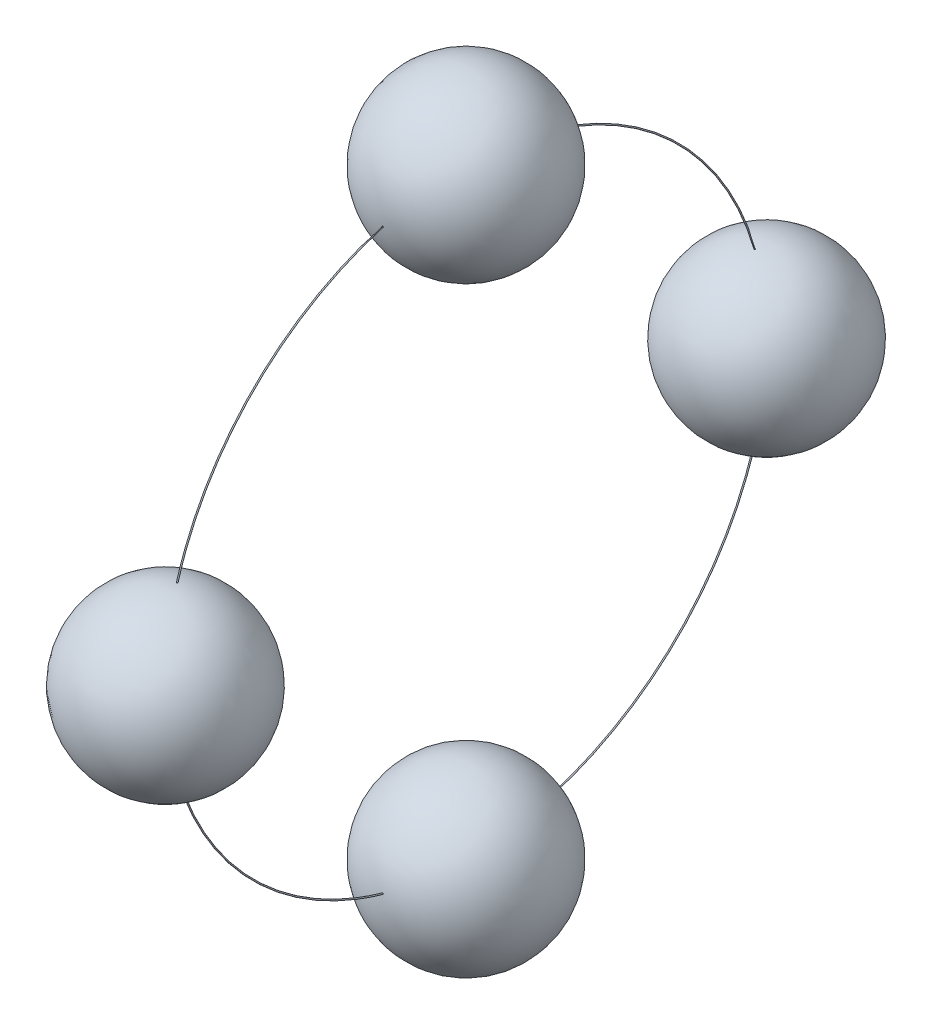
ISO-10303-21;
HEADER;
FILE_DESCRIPTION(('STEP AP214'),'2;1');
FILE_NAME('part.step','',(''),(''),'','','');
FILE_SCHEMA(('AUTOMOTIVE_DESIGN { 1 0 10303 214 1 1 1 1 }'));
ENDSEC;
DATA;
#1=APPLICATION_CONTEXT('core data for automotive mechanical design processes');
#2=APPLICATION_PROTOCOL_DEFINITION('international standard','automotive_design',2000,#1);
#3=PRODUCT_CONTEXT('',#1,'mechanical');
#4=PRODUCT('Part','Part','',(#3));
#5=PRODUCT_RELATED_PRODUCT_CATEGORY('part','',(#4));
#6=PRODUCT_DEFINITION_FORMATION('','',#4);
#7=PRODUCT_DEFINITION_CONTEXT('part definition',#1,'design');
#8=PRODUCT_DEFINITION('design','',#6,#7);
#9=PRODUCT_DEFINITION_SHAPE('','',#8);
#10=(LENGTH_UNIT() NAMED_UNIT(*) SI_UNIT(.MILLI.,.METRE.));
#11=(NAMED_UNIT(*) PLANE_ANGLE_UNIT() SI_UNIT($,.RADIAN.));
#12=(NAMED_UNIT(*) SI_UNIT($,.STERADIAN.) SOLID_ANGLE_UNIT());
#13=UNCERTAINTY_MEASURE_WITH_UNIT(LENGTH_MEASURE(1.E-05),#10,'distance_accuracy_value','');
#14=(GEOMETRIC_REPRESENTATION_CONTEXT(3) GLOBAL_UNCERTAINTY_ASSIGNED_CONTEXT((#13)) GLOBAL_UNIT_ASSIGNED_CONTEXT((#10,
#11,#12)) REPRESENTATION_CONTEXT('',''));
#15=CARTESIAN_POINT('',(0.,0.,0.));
#16=DIRECTION('',(0.,0.,1.));
#17=DIRECTION('',(1.,0.,0.));
#18=AXIS2_PLACEMENT_3D('',#15,#16,#17);
#19=CARTESIAN_POINT('',(4.5,0.,0.));
#20=DIRECTION('',(1.,0.,0.));
#21=DIRECTION('',(0.,-1.,0.));
#22=AXIS2_PLACEMENT_3D('',#19,#20,#21);
#23=TOROIDAL_SURFACE('',#22,10.,0.02);
#24=CARTESIAN_POINT('',(4.48828860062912,-2.77464620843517,-9.6242324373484));
#25=CARTESIAN_POINT('',(4.48737404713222,-2.77455286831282,-9.62357172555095));
#26=CARTESIAN_POINT('',(4.48651555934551,-2.77444856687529,-9.62283345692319));
#27=CARTESIAN_POINT('',(4.48493558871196,-2.77422113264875,-9.621223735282));
#28=CARTESIAN_POINT('',(4.48421428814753,-2.77409797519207,-9.62035210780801));
#29=CARTESIAN_POINT('',(4.48292990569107,-2.77383658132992,-9.61850227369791));
#30=CARTESIAN_POINT('',(4.48236668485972,-2.77369835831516,-9.61752416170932));
#31=CARTESIAN_POINT('',(4.48141298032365,-2.77341073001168,-9.61548897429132));
#32=CARTESIAN_POINT('',(4.48102245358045,-2.77326132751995,-9.61443191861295));
#33=CARTESIAN_POINT('',(4.48042217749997,-2.77295446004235,-9.61226094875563));
#34=CARTESIAN_POINT('',(4.48021366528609,-2.77279694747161,-9.61114669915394));
#35=CARTESIAN_POINT('',(4.47998744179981,-2.77247922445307,-9.60889931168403));
#36=CARTESIAN_POINT('',(4.47996974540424,-2.7723190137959,-9.60776617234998));
#37=CARTESIAN_POINT('',(4.48012605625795,-2.77199957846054,-9.60550706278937));
#38=CARTESIAN_POINT('',(4.48030104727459,-2.77184036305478,-9.60438115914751));
#39=CARTESIAN_POINT('',(4.48083963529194,-2.77152828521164,-9.60217446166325));
#40=CARTESIAN_POINT('',(4.48120323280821,-2.77137542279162,-9.60109366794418));
#41=CARTESIAN_POINT('',(4.48210873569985,-2.7710805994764,-9.59900932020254));
#42=CARTESIAN_POINT('',(4.48265044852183,-2.77093862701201,-9.59800568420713));
#43=CARTESIAN_POINT('',(4.48389747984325,-2.77066953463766,-9.59610354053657));
#44=CARTESIAN_POINT('',(4.48460279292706,-2.77054241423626,-9.59520502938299));
#45=CARTESIAN_POINT('',(4.48615200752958,-2.77030760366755,-9.59354544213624));
#46=CARTESIAN_POINT('',(4.4869949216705,-2.77019978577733,-9.59278346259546));
#47=CARTESIAN_POINT('',(4.48879907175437,-2.77000573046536,-9.59141208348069));
#48=CARTESIAN_POINT('',(4.4897603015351,-2.76991949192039,-9.59080267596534));
#49=CARTESIAN_POINT('',(4.49176384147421,-2.76977193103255,-9.58975996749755));
#50=CARTESIAN_POINT('',(4.49280527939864,-2.76971037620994,-9.58932502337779));
#51=CARTESIAN_POINT('',(4.49494749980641,-2.76961286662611,-9.58863603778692));
#52=CARTESIAN_POINT('',(4.49604827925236,-2.76957691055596,-9.58838198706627));
#53=CARTESIAN_POINT('',(4.49826835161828,-2.76953188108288,-9.58806382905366));
#54=CARTESIAN_POINT('',(4.49938742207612,-2.76952259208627,-9.5879981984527));
#55=CARTESIAN_POINT('',(4.50162072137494,-2.76953056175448,-9.58805450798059));
#56=CARTESIAN_POINT('',(4.50273495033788,-2.76954781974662,-9.58817644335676));
#57=CARTESIAN_POINT('',(4.50492351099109,-2.76960826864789,-9.58860355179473));
#58=CARTESIAN_POINT('',(4.50599795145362,-2.7696513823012,-9.58890817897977));
#59=CARTESIAN_POINT('',(4.50808018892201,-2.76976218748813,-9.58969112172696));
#60=CARTESIAN_POINT('',(4.50908798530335,-2.76982987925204,-9.59016943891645));
#61=CARTESIAN_POINT('',(4.51101222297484,-2.76998811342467,-9.59128759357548));
#62=CARTESIAN_POINT('',(4.51192834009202,-2.77007873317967,-9.59192797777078));
#63=CARTESIAN_POINT('',(4.51364012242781,-2.77028006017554,-9.5933507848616));
#64=CARTESIAN_POINT('',(4.5144357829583,-2.77039076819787,-9.59413321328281));
#65=CARTESIAN_POINT('',(4.51589120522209,-2.77063008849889,-9.59582472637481));
#66=CARTESIAN_POINT('',(4.51654978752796,-2.77075884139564,-9.59673480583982));
#67=CARTESIAN_POINT('',(4.51770501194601,-2.77102986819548,-9.59865068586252));
#68=CARTESIAN_POINT('',(4.51820164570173,-2.77117214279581,-9.59965649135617));
#69=CARTESIAN_POINT('',(4.51902376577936,-2.77146762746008,-9.60174558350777));
#70=CARTESIAN_POINT('',(4.51934757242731,-2.77162092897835,-9.60282951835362));
#71=CARTESIAN_POINT('',(4.5198081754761,-2.77193292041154,-9.60503567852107));
#72=CARTESIAN_POINT('',(4.51994496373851,-2.77209161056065,-9.60615790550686));
#73=CARTESIAN_POINT('',(4.52002819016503,-2.77241100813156,-9.60841682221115));
#74=CARTESIAN_POINT('',(4.51997334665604,-2.77257172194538,-9.60955355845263));
#75=CARTESIAN_POINT('',(4.51967191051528,-2.77288956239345,-9.6118018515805));
#76=CARTESIAN_POINT('',(4.51942531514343,-2.7730466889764,-9.61291340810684));
#77=CARTESIAN_POINT('',(4.51874665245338,-2.7733530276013,-9.61508070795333));
#78=CARTESIAN_POINT('',(4.5183144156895,-2.77350223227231,-9.61613639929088));
#79=CARTESIAN_POINT('',(4.51727615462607,-2.7737882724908,-9.61816041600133));
#80=CARTESIAN_POINT('',(4.51667013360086,-2.77392510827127,-9.61912874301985));
#81=CARTESIAN_POINT('',(4.51530467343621,-2.77418172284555,-9.62094481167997));
#82=CARTESIAN_POINT('',(4.51454606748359,-2.77430158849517,-9.62179316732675));
#83=CARTESIAN_POINT('',(4.5128945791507,-2.77452158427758,-9.62335028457));
#84=CARTESIAN_POINT('',(4.51200170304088,-2.77462171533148,-9.62405905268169));
#85=CARTESIAN_POINT('',(4.51011578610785,-2.77479841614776,-9.62530986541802));
#86=CARTESIAN_POINT('',(4.50912374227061,-2.77487519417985,-9.62585338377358));
#87=CARTESIAN_POINT('',(4.50706100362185,-2.77500411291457,-9.6267660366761));
#88=CARTESIAN_POINT('',(4.50599031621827,-2.77505625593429,-9.62713518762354));
#89=CARTESIAN_POINT('',(4.50381115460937,-2.77513396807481,-9.62768536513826));
#90=CARTESIAN_POINT('',(4.50270311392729,-2.77515977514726,-9.62786807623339));
#91=CARTESIAN_POINT('',(4.50047148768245,-2.77518487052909,-9.62804574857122));
#92=CARTESIAN_POINT('',(4.49934789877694,-2.7751841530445,-9.62804066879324));
#93=CARTESIAN_POINT('',(4.49712266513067,-2.77515627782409,-9.62784331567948));
#94=CARTESIAN_POINT('',(4.49602094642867,-2.77512923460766,-9.6276518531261));
#95=CARTESIAN_POINT('',(4.49386652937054,-2.77504969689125,-9.62708875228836));
#96=CARTESIAN_POINT('',(4.49281377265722,-2.77499723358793,-9.62671733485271));
#97=CARTESIAN_POINT('',(4.49118208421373,-2.7748936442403,-9.62598399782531));
#98=CARTESIAN_POINT('',(4.49057839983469,-2.77484996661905,-9.6256747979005));
#99=CARTESIAN_POINT('',(4.48940595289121,-2.77475424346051,-9.6249971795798));
#100=CARTESIAN_POINT('',(4.48883719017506,-2.77470219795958,-9.62462876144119));
#101=CARTESIAN_POINT('',(4.48828860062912,-2.77464620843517,-9.6242324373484));
#102=B_SPLINE_CURVE_WITH_KNOTS('',3,(#24,#25,#26,#27,#28,#29,#30,#31,#32,#33,#34,#35,#36,#37,
#38,#39,#40,#41,#42,#43,#44,#45,#46,#47,#48,#49,#50,#51,#52,#53,#54,#55,#56,#57,#58,#59,#60,#61,
#62,#63,#64,#65,#66,#67,#68,#69,#70,#71,#72,#73,#74,#75,#76,#77,#78,#79,#80,#81,#82,#83,#84,#85,
#86,#87,#88,#89,#90,#91,#92,#93,#94,#95,#96,#97,#98,#99,#100,#101),.UNSPECIFIED.,.T.,.F.,(4,2,2,
2,2,2,2,2,2,2,2,2,2,2,2,2,2,2,2,2,2,2,2,2,2,2,2,2,2,2,2,2,2,2,2,2,2,2,4),(0.,
0.00339380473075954,0.00679208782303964,0.0101873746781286,0.0135818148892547,
0.0169991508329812,0.0204167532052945,0.0238518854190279,0.0272870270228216,0.0307184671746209,
0.0341497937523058,0.0375575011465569,0.0409650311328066,0.0443396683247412,0.0477141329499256,
0.0510612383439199,0.0544082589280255,0.0577453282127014,0.0610824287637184,0.0644309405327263,
0.067779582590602,0.0711559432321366,0.0745324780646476,0.0779412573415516,0.0813501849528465,
0.0847819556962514,0.0882137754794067,0.0916487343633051,0.0950836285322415,0.098500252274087,
0.101916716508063,0.105301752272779,0.108686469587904,0.112040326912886,0.115394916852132,
0.118734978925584,0.122070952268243,0.124106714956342,0.126142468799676),.UNSPECIFIED.);
#103=CARTESIAN_POINT('',(4.48828860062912,-2.77464620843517,-9.6242324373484));
#104=VERTEX_POINT('',#103);
#105=EDGE_CURVE('E10',#104,#104,#102,.T.);
#106=ORIENTED_EDGE('',*,*,#105,.F.);
#107=EDGE_LOOP('',(#106));
#108=FACE_BOUND('',#107,.T.);
#109=CARTESIAN_POINT('',(4.48828860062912,-9.6242324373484,-2.77464620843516));
#110=CARTESIAN_POINT('',(4.48919121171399,-9.62488439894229,-2.77473831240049));
#111=CARTESIAN_POINT('',(4.49014972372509,-9.6254617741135,-2.77481987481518));
#112=CARTESIAN_POINT('',(4.49215171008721,-9.6264496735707,-2.77495942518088));
#113=CARTESIAN_POINT('',(4.49319527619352,-9.62686001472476,-2.77501738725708));
#114=CARTESIAN_POINT('',(4.4953371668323,-9.62750093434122,-2.77510791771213));
#115=CARTESIAN_POINT('',(4.49643548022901,-9.627731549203,-2.77514049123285));
#116=CARTESIAN_POINT('',(4.49865538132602,-9.62800606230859,-2.77517926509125));
#117=CARTESIAN_POINT('',(4.49977696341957,-9.62805000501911,-2.77518547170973));
#118=CARTESIAN_POINT('',(4.50200740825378,-9.62795017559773,-2.7751713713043));
#119=CARTESIAN_POINT('',(4.50311630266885,-9.62780709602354,-2.77515116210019));
#120=CARTESIAN_POINT('',(4.50529413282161,-9.62733871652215,-2.77508500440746));
#121=CARTESIAN_POINT('',(4.50636306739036,-9.62701341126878,-2.7750390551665));
#122=CARTESIAN_POINT('',(4.5084314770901,-9.6261900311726,-2.77492274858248));
#123=CARTESIAN_POINT('',(4.50943090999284,-9.62569185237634,-2.77485237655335));
#124=CARTESIAN_POINT('',(4.5113318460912,-9.62453744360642,-2.77468929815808));
#125=CARTESIAN_POINT('',(4.51223334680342,-9.62388120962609,-2.77459659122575));
#126=CARTESIAN_POINT('',(4.51391921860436,-9.62242499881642,-2.7743908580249));
#127=CARTESIAN_POINT('',(4.51470279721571,-9.62162412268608,-2.77427770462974));
#128=CARTESIAN_POINT('',(4.51612458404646,-9.6199045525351,-2.77403473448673));
#129=CARTESIAN_POINT('',(4.51676278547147,-9.61898585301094,-2.77390491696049));
#130=CARTESIAN_POINT('',(4.51788212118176,-9.61704740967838,-2.77363098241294));
#131=CARTESIAN_POINT('',(4.51836171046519,-9.61602679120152,-2.77348674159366));
#132=CARTESIAN_POINT('',(4.51914268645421,-9.61392076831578,-2.7731890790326));
#133=CARTESIAN_POINT('',(4.51944406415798,-9.61283536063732,-2.77303565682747));
#134=CARTESIAN_POINT('',(4.51986244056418,-9.61062075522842,-2.77272259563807));
#135=CARTESIAN_POINT('',(4.5199778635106,-9.60949126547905,-2.77256291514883));
#136=CARTESIAN_POINT('',(4.52001635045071,-9.60722906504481,-2.7722430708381));
#137=CARTESIAN_POINT('',(4.51993940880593,-9.6060963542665,-2.77208290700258));
#138=CARTESIAN_POINT('',(4.51959454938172,-9.60385544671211,-2.77176601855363));
#139=CARTESIAN_POINT('',(4.51932592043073,-9.60274735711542,-2.77160930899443));
#140=CARTESIAN_POINT('',(4.51860410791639,-9.60059173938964,-2.77130442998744));
#141=CARTESIAN_POINT('',(4.51815092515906,-9.59954421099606,-2.77115626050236));
#142=CARTESIAN_POINT('',(4.5170737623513,-9.59754265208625,-2.77087312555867));
#143=CARTESIAN_POINT('',(4.5164502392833,-9.59658838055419,-2.77073812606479));
#144=CARTESIAN_POINT('',(4.51504903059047,-9.59479810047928,-2.7704848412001));
#145=CARTESIAN_POINT('',(4.51427135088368,-9.59396208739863,-2.77036655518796));
#146=CARTESIAN_POINT('',(4.51259036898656,-9.59243928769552,-2.77015108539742));
#147=CARTESIAN_POINT('',(4.51168811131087,-9.59175137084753,-2.77005374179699));
#148=CARTESIAN_POINT('',(4.50977881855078,-9.5905370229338,-2.76988189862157));
#149=CARTESIAN_POINT('',(4.50877178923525,-9.5900105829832,-2.76980739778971));
#150=CARTESIAN_POINT('',(4.50669202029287,-9.58913943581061,-2.76968411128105));
#151=CARTESIAN_POINT('',(4.50562001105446,-9.58879301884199,-2.76963508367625));
#152=CARTESIAN_POINT('',(4.50343226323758,-9.58828473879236,-2.76956314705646));
#153=CARTESIAN_POINT('',(4.50231652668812,-9.5881228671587,-2.76954023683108));
#154=CARTESIAN_POINT('',(4.5000814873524,-9.58798907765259,-2.76952130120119));
#155=CARTESIAN_POINT('',(4.49896226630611,-9.58801581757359,-2.76952508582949));
#156=CARTESIAN_POINT('',(4.49674432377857,-9.58825526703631,-2.7695589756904));
#157=CARTESIAN_POINT('',(4.4956456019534,-9.58846797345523,-2.76958908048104));
#158=CARTESIAN_POINT('',(4.49350134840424,-9.58907252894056,-2.76967464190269));
#159=CARTESIAN_POINT('',(4.49245574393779,-9.58946412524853,-2.76973006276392));
#160=CARTESIAN_POINT('',(4.49044532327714,-9.59041475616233,-2.76986459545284));
#161=CARTESIAN_POINT('',(4.48948050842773,-9.59097379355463,-2.76994370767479));
#162=CARTESIAN_POINT('',(4.48765384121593,-9.59224605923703,-2.77012374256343));
#163=CARTESIAN_POINT('',(4.48679251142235,-9.59296002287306,-2.77022476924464));
#164=CARTESIAN_POINT('',(4.48520179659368,-9.59451984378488,-2.77044547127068));
#165=CARTESIAN_POINT('',(4.48447241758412,-9.59536570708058,-2.77056514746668));
#166=CARTESIAN_POINT('',(4.48315927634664,-9.59717338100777,-2.77082088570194));
#167=CARTESIAN_POINT('',(4.48257687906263,-9.59813616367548,-2.77095708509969));
#168=CARTESIAN_POINT('',(4.48158186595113,-9.60014420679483,-2.77124112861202));
#169=CARTESIAN_POINT('',(4.48116925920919,-9.60118947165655,-2.77138897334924));
#170=CARTESIAN_POINT('',(4.48052172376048,-9.60334316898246,-2.7716935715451));
#171=CARTESIAN_POINT('',(4.48028847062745,-9.60445209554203,-2.77185039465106));
#172=CARTESIAN_POINT('',(4.48001217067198,-9.60669291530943,-2.7721672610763));
#173=CARTESIAN_POINT('',(4.47996912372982,-9.60782480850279,-2.77232730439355));
#174=CARTESIAN_POINT('',(4.48007464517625,-9.61008592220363,-2.77264698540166));
#175=CARTESIAN_POINT('',(4.4802242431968,-9.61121509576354,-2.77280661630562));
#176=CARTESIAN_POINT('',(4.48071294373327,-9.61343284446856,-2.77312011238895));
#177=CARTESIAN_POINT('',(4.48105209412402,-9.61452140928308,-2.77327397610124));
#178=CARTESIAN_POINT('',(4.48191060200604,-9.61662614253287,-2.77357144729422));
#179=CARTESIAN_POINT('',(4.48242992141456,-9.61764232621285,-2.77371505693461));
#180=CARTESIAN_POINT('',(4.48363428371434,-9.61957223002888,-2.7739877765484));
#181=CARTESIAN_POINT('',(4.48431912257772,-9.62048607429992,-2.7741169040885));
#182=CARTESIAN_POINT('',(4.48555720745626,-9.62187380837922,-2.77431298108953));
#183=CARTESIAN_POINT('',(4.48606697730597,-9.6223863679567,-2.77438539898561));
#184=CARTESIAN_POINT('',(4.48713950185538,-9.62335392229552,-2.77452209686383));
#185=CARTESIAN_POINT('',(4.48770225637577,-9.62380891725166,-2.7745863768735));
#186=CARTESIAN_POINT('',(4.48828860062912,-9.6242324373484,-2.77464620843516));
#187=B_SPLINE_CURVE_WITH_KNOTS('',3,(#109,#110,#111,#112,#113,#114,#115,#116,#117,#118,#119,
#120,#121,#122,#123,#124,#125,#126,#127,#128,#129,#130,#131,#132,#133,#134,#135,#136,#137,#138,
#139,#140,#141,#142,#143,#144,#145,#146,#147,#148,#149,#150,#151,#152,#153,#154,#155,#156,#157,
#158,#159,#160,#161,#162,#163,#164,#165,#166,#167,#168,#169,#170,#171,#172,#173,#174,#175,#176,
#177,#178,#179,#180,#181,#182,#183,#184,#185,#186),.UNSPECIFIED.,.T.,.F.,(4,2,2,2,2,2,2,2,2,2,2,
2,2,2,2,2,2,2,2,2,2,2,2,2,2,2,2,2,2,2,2,2,2,2,2,2,2,2,4),(0.,0.00334912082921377,
0.00670190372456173,0.0100540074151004,0.0134053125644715,0.0167442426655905,0.0200832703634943,
0.0234243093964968,0.0267654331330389,0.0301280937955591,0.0334909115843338,0.0368855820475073,
0.040280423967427,0.0437038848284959,0.0471274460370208,0.0505637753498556,0.0540000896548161,
0.0574272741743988,0.0608543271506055,0.0642542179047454,0.0676539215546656,0.071020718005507,
0.0743873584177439,0.0777300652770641,0.0810727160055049,0.0844106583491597,0.0877486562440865,
0.0911028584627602,0.0944572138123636,0.0978416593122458,0.101226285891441,0.104642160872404,
0.108058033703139,0.111492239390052,0.11492731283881,0.118361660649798,0.121791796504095,
0.123967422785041,0.126143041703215),.UNSPECIFIED.);
#188=CARTESIAN_POINT('',(4.48828860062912,-9.6242324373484,-2.77464620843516));
#189=VERTEX_POINT('',#188);
#190=EDGE_CURVE('E35',#189,#189,#187,.T.);
#191=ORIENTED_EDGE('',*,*,#190,.F.);
#192=EDGE_LOOP('',(#191));
#193=FACE_BOUND('',#192,.T.);
#194=ADVANCED_FACE('F14',(#108,#193),#23,.T.);
#195=CARTESIAN_POINT('',(4.48828860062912,2.77464620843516,-9.6242324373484));
#196=CARTESIAN_POINT('',(4.48919121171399,2.77473831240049,-9.62488439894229));
#197=CARTESIAN_POINT('',(4.49014972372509,2.77481987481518,-9.6254617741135));
#198=CARTESIAN_POINT('',(4.49215171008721,2.77495942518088,-9.6264496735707));
#199=CARTESIAN_POINT('',(4.49319527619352,2.77501738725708,-9.62686001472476));
#200=CARTESIAN_POINT('',(4.4953371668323,2.77510791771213,-9.62750093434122));
#201=CARTESIAN_POINT('',(4.49643548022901,2.77514049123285,-9.627731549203));
#202=CARTESIAN_POINT('',(4.49865538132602,2.77517926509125,-9.62800606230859));
#203=CARTESIAN_POINT('',(4.49977696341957,2.77518547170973,-9.62805000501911));
#204=CARTESIAN_POINT('',(4.50200740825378,2.7751713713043,-9.62795017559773));
#205=CARTESIAN_POINT('',(4.50311630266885,2.77515116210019,-9.62780709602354));
#206=CARTESIAN_POINT('',(4.50529413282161,2.77508500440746,-9.62733871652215));
#207=CARTESIAN_POINT('',(4.50636306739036,2.7750390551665,-9.62701341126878));
#208=CARTESIAN_POINT('',(4.5084314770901,2.77492274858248,-9.6261900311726));
#209=CARTESIAN_POINT('',(4.50943090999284,2.77485237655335,-9.62569185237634));
#210=CARTESIAN_POINT('',(4.5113318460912,2.77468929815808,-9.62453744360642));
#211=CARTESIAN_POINT('',(4.51223334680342,2.77459659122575,-9.62388120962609));
#212=CARTESIAN_POINT('',(4.51391921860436,2.7743908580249,-9.62242499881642));
#213=CARTESIAN_POINT('',(4.51470279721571,2.77427770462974,-9.62162412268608));
#214=CARTESIAN_POINT('',(4.51612458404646,2.77403473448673,-9.6199045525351));
#215=CARTESIAN_POINT('',(4.51676278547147,2.77390491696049,-9.61898585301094));
#216=CARTESIAN_POINT('',(4.51788212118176,2.77363098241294,-9.61704740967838));
#217=CARTESIAN_POINT('',(4.51836171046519,2.77348674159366,-9.61602679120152));
#218=CARTESIAN_POINT('',(4.51914268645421,2.7731890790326,-9.61392076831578));
#219=CARTESIAN_POINT('',(4.51944406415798,2.77303565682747,-9.61283536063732));
#220=CARTESIAN_POINT('',(4.51986244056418,2.77272259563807,-9.61062075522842));
#221=CARTESIAN_POINT('',(4.5199778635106,2.77256291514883,-9.60949126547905));
#222=CARTESIAN_POINT('',(4.52001635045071,2.7722430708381,-9.60722906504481));
#223=CARTESIAN_POINT('',(4.51993940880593,2.77208290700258,-9.6060963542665));
#224=CARTESIAN_POINT('',(4.51959454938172,2.77176601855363,-9.60385544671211));
#225=CARTESIAN_POINT('',(4.51932592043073,2.77160930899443,-9.60274735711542));
#226=CARTESIAN_POINT('',(4.51860410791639,2.77130442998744,-9.60059173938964));
#227=CARTESIAN_POINT('',(4.51815092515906,2.77115626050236,-9.59954421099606));
#228=CARTESIAN_POINT('',(4.5170737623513,2.77087312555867,-9.59754265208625));
#229=CARTESIAN_POINT('',(4.5164502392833,2.77073812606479,-9.59658838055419));
#230=CARTESIAN_POINT('',(4.51504903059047,2.7704848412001,-9.59479810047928));
#231=CARTESIAN_POINT('',(4.51427135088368,2.77036655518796,-9.59396208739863));
#232=CARTESIAN_POINT('',(4.51259036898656,2.77015108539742,-9.59243928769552));
#233=CARTESIAN_POINT('',(4.51168811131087,2.77005374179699,-9.59175137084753));
#234=CARTESIAN_POINT('',(4.50977881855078,2.76988189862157,-9.5905370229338));
#235=CARTESIAN_POINT('',(4.50877178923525,2.76980739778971,-9.5900105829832));
#236=CARTESIAN_POINT('',(4.50669202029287,2.76968411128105,-9.58913943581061));
#237=CARTESIAN_POINT('',(4.50562001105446,2.76963508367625,-9.58879301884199));
#238=CARTESIAN_POINT('',(4.50343226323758,2.76956314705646,-9.58828473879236));
#239=CARTESIAN_POINT('',(4.50231652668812,2.76954023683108,-9.5881228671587));
#240=CARTESIAN_POINT('',(4.5000814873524,2.76952130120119,-9.58798907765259));
#241=CARTESIAN_POINT('',(4.49896226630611,2.76952508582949,-9.58801581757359));
#242=CARTESIAN_POINT('',(4.49674432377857,2.7695589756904,-9.58825526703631));
#243=CARTESIAN_POINT('',(4.4956456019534,2.76958908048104,-9.58846797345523));
#244=CARTESIAN_POINT('',(4.49350134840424,2.76967464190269,-9.58907252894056));
#245=CARTESIAN_POINT('',(4.49245574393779,2.76973006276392,-9.58946412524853));
#246=CARTESIAN_POINT('',(4.49044532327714,2.76986459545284,-9.59041475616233));
#247=CARTESIAN_POINT('',(4.48948050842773,2.76994370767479,-9.59097379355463));
#248=CARTESIAN_POINT('',(4.48765384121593,2.77012374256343,-9.59224605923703));
#249=CARTESIAN_POINT('',(4.48679251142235,2.77022476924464,-9.59296002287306));
#250=CARTESIAN_POINT('',(4.48520179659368,2.77044547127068,-9.59451984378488));
#251=CARTESIAN_POINT('',(4.48447241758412,2.77056514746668,-9.59536570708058));
#252=CARTESIAN_POINT('',(4.48315927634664,2.77082088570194,-9.59717338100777));
#253=CARTESIAN_POINT('',(4.48257687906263,2.77095708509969,-9.59813616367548));
#254=CARTESIAN_POINT('',(4.48158186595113,2.77124112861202,-9.60014420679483));
#255=CARTESIAN_POINT('',(4.48116925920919,2.77138897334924,-9.60118947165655));
#256=CARTESIAN_POINT('',(4.48052172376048,2.7716935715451,-9.60334316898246));
#257=CARTESIAN_POINT('',(4.48028847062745,2.77185039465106,-9.60445209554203));
#258=CARTESIAN_POINT('',(4.48001217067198,2.7721672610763,-9.60669291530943));
#259=CARTESIAN_POINT('',(4.47996912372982,2.77232730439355,-9.60782480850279));
#260=CARTESIAN_POINT('',(4.48007464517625,2.77264698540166,-9.61008592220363));
#261=CARTESIAN_POINT('',(4.4802242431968,2.77280661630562,-9.61121509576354));
#262=CARTESIAN_POINT('',(4.48071294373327,2.77312011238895,-9.61343284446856));
#263=CARTESIAN_POINT('',(4.48105209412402,2.77327397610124,-9.61452140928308));
#264=CARTESIAN_POINT('',(4.48191060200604,2.77357144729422,-9.61662614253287));
#265=CARTESIAN_POINT('',(4.48242992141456,2.77371505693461,-9.61764232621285));
#266=CARTESIAN_POINT('',(4.48363428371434,2.7739877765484,-9.61957223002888));
#267=CARTESIAN_POINT('',(4.48431912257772,2.7741169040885,-9.62048607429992));
#268=CARTESIAN_POINT('',(4.48555720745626,2.77431298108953,-9.62187380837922));
#269=CARTESIAN_POINT('',(4.48606697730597,2.77438539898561,-9.6223863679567));
#270=CARTESIAN_POINT('',(4.48713950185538,2.77452209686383,-9.62335392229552));
#271=CARTESIAN_POINT('',(4.48770225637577,2.7745863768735,-9.62380891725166));
#272=CARTESIAN_POINT('',(4.48828860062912,2.77464620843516,-9.6242324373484));
#273=B_SPLINE_CURVE_WITH_KNOTS('',3,(#195,#196,#197,#198,#199,#200,#201,#202,#203,#204,#205,
#206,#207,#208,#209,#210,#211,#212,#213,#214,#215,#216,#217,#218,#219,#220,#221,#222,#223,#224,
#225,#226,#227,#228,#229,#230,#231,#232,#233,#234,#235,#236,#237,#238,#239,#240,#241,#242,#243,
#244,#245,#246,#247,#248,#249,#250,#251,#252,#253,#254,#255,#256,#257,#258,#259,#260,#261,#262,
#263,#264,#265,#266,#267,#268,#269,#270,#271,#272),.UNSPECIFIED.,.T.,.F.,(4,2,2,2,2,2,2,2,2,2,2,
2,2,2,2,2,2,2,2,2,2,2,2,2,2,2,2,2,2,2,2,2,2,2,2,2,2,2,4),(0.,0.00334912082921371,
0.00670190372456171,0.0100540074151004,0.0134053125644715,0.0167442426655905,0.0200832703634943,
0.0234243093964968,0.0267654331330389,0.0301280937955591,0.0334909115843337,0.0368855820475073,
0.040280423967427,0.0437038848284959,0.0471274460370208,0.0505637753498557,0.0540000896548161,
0.0574272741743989,0.0608543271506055,0.0642542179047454,0.0676539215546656,0.0710207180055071,
0.0743873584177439,0.0777300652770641,0.0810727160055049,0.0844106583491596,0.0877486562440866,
0.0911028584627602,0.0944572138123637,0.0978416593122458,0.101226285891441,0.104642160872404,
0.108058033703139,0.111492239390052,0.11492731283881,0.118361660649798,0.121791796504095,
0.123967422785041,0.126143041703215),.UNSPECIFIED.);
#274=CARTESIAN_POINT('',(4.48828860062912,2.77464620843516,-9.6242324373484));
#275=VERTEX_POINT('',#274);
#276=EDGE_CURVE('E26',#275,#275,#273,.T.);
#277=ORIENTED_EDGE('',*,*,#276,.F.);
#278=EDGE_LOOP('',(#277));
#279=FACE_BOUND('',#278,.T.);
#280=CARTESIAN_POINT('',(4.48906500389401,9.59127407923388,-2.76998619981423));
#281=CARTESIAN_POINT('',(4.48999689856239,9.59066561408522,-2.76990009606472));
#282=CARTESIAN_POINT('',(4.49098105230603,9.59013423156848,-2.76982489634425));
#283=CARTESIAN_POINT('',(4.4930262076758,9.58924199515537,-2.76969862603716));
#284=CARTESIAN_POINT('',(4.49408729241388,9.58888132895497,-2.76964758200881));
#285=CARTESIAN_POINT('',(4.49625549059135,9.58834194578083,-2.76957124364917));
#286=CARTESIAN_POINT('',(4.49736259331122,9.58816318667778,-2.76954594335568));
#287=CARTESIAN_POINT('',(4.49959111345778,9.58799298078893,-2.76952185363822));
#288=CARTESIAN_POINT('',(4.50071252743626,9.5880014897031,-2.76952305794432));
#289=CARTESIAN_POINT('',(4.50293436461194,9.58820510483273,-2.76955187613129));
#290=CARTESIAN_POINT('',(4.50403484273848,9.58839962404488,-2.76957940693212));
#291=CARTESIAN_POINT('',(4.50618730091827,9.58896858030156,-2.76965993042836));
#292=CARTESIAN_POINT('',(4.50723927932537,9.5893430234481,-2.76971292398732));
#293=CARTESIAN_POINT('',(4.50926673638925,9.59026139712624,-2.76984289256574));
#294=CARTESIAN_POINT('',(4.51024209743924,9.59080558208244,-2.76991990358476));
#295=CARTESIAN_POINT('',(4.51208756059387,9.59204727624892,-2.77009561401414));
#296=CARTESIAN_POINT('',(4.51295765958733,9.59274478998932,-2.7701943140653));
#297=CARTESIAN_POINT('',(4.51457467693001,9.59427848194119,-2.77041132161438));
#298=CARTESIAN_POINT('',(4.51532067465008,9.59511561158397,-2.77052976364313));
#299=CARTESIAN_POINT('',(4.51666175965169,9.59690098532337,-2.77078235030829));
#300=CARTESIAN_POINT('',(4.51725683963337,9.59784923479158,-2.77091649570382));
#301=CARTESIAN_POINT('',(4.51828522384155,9.59983969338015,-2.77119805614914));
#302=CARTESIAN_POINT('',(4.51871691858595,9.60088271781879,-2.77134558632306));
#303=CARTESIAN_POINT('',(4.51939891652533,9.60302537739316,-2.77164862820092));
#304=CARTESIAN_POINT('',(4.51964921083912,9.60412501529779,-2.77180414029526));
#305=CARTESIAN_POINT('',(4.5199630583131,9.60635906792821,-2.77212005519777));
#306=CARTESIAN_POINT('',(4.52002510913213,9.60749368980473,-2.77228048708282));
#307=CARTESIAN_POINT('',(4.51995655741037,9.6097572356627,-2.77260051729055));
#308=CARTESIAN_POINT('',(4.51982595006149,9.61088615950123,-2.77276011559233));
#309=CARTESIAN_POINT('',(4.5193748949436,9.61310957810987,-2.77307441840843));
#310=CARTESIAN_POINT('',(4.51905390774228,9.61420396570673,-2.77322910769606));
#311=CARTESIAN_POINT('',(4.51823028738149,9.61632357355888,-2.77352868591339));
#312=CARTESIAN_POINT('',(4.51772765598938,9.61734879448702,-2.77367357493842));
#313=CARTESIAN_POINT('',(4.5165565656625,9.61929683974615,-2.77394886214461));
#314=CARTESIAN_POINT('',(4.51588870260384,9.62022001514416,-2.77407931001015));
#315=CARTESIAN_POINT('',(4.51440469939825,9.62194104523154,-2.77432248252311));
#316=CARTESIAN_POINT('',(4.51358856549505,9.62273890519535,-2.77443520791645));
#317=CARTESIAN_POINT('',(4.51183844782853,9.62417935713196,-2.77463871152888));
#318=CARTESIAN_POINT('',(4.51090551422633,9.62482319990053,-2.77472966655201));
#319=CARTESIAN_POINT('',(4.50894288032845,9.62594490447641,-2.77488812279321));
#320=CARTESIAN_POINT('',(4.50791318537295,9.62642277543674,-2.77495562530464));
#321=CARTESIAN_POINT('',(4.50579682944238,9.62719428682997,-2.77506460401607));
#322=CARTESIAN_POINT('',(4.50471080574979,9.62748964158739,-2.77510632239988));
#323=CARTESIAN_POINT('',(4.50250397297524,9.62789431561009,-2.77516348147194));
#324=CARTESIAN_POINT('',(4.50138316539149,9.6280036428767,-2.77517892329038));
#325=CARTESIAN_POINT('',(4.49914626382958,9.62803285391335,-2.77518304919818));
#326=CARTESIAN_POINT('',(4.49803018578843,9.62795394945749,-2.77517190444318));
#327=CARTESIAN_POINT('',(4.49582730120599,9.62761160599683,-2.77512354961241));
#328=CARTESIAN_POINT('',(4.49474049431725,9.62734816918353,-2.77508633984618));
#329=CARTESIAN_POINT('',(4.49262741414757,9.62664483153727,-2.77498699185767));
#330=CARTESIAN_POINT('',(4.49160111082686,9.62620501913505,-2.77492486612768));
#331=CARTESIAN_POINT('',(4.48963707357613,9.62516194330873,-2.7747775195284));
#332=CARTESIAN_POINT('',(4.48869934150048,9.6245586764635,-2.7746922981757));
#333=CARTESIAN_POINT('',(4.48693327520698,9.62320246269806,-2.77450069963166));
#334=CARTESIAN_POINT('',(4.48610558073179,9.62244869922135,-2.7743942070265));
#335=CARTESIAN_POINT('',(4.48458830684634,9.62081540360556,-2.77416343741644));
#336=CARTESIAN_POINT('',(4.48389873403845,9.61993586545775,-2.77403915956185));
#337=CARTESIAN_POINT('',(4.48267047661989,9.61806734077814,-2.77377511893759));
#338=CARTESIAN_POINT('',(4.48213324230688,9.61707741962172,-2.77363522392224));
#339=CARTESIAN_POINT('',(4.48123253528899,9.61502289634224,-2.77334485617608));
#340=CARTESIAN_POINT('',(4.48086907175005,9.61395829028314,-2.77319438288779));
#341=CARTESIAN_POINT('',(4.48032304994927,9.61177442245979,-2.77288568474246));
#342=CARTESIAN_POINT('',(4.4801421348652,9.61065475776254,-2.77272740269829));
#343=CARTESIAN_POINT('',(4.47997173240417,9.60840126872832,-2.7724088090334));
#344=CARTESIAN_POINT('',(4.47998224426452,9.6072674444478,-2.77224849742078));
#345=CARTESIAN_POINT('',(4.48019489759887,9.60501223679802,-2.77192960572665));
#346=CARTESIAN_POINT('',(4.48039792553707,9.60389093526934,-2.77177103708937));
#347=CARTESIAN_POINT('',(4.48099157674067,9.60169777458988,-2.77146086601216));
#348=CARTESIAN_POINT('',(4.48138224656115,9.60062592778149,-2.77130926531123));
#349=CARTESIAN_POINT('',(4.48234000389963,9.59856400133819,-2.77101760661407));
#350=CARTESIAN_POINT('',(4.48290690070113,9.59757383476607,-2.77087753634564));
#351=CARTESIAN_POINT('',(4.48420135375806,9.59570362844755,-2.77061295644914));
#352=CARTESIAN_POINT('',(4.48492871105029,9.59482345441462,-2.77048842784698));
#353=CARTESIAN_POINT('',(4.48623027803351,9.59349708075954,-2.77030075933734));
#354=CARTESIAN_POINT('',(4.48676281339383,9.59301011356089,-2.7702318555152));
#355=CARTESIAN_POINT('',(4.48787790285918,9.59209597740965,-2.77010250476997));
#356=CARTESIAN_POINT('',(4.48846045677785,9.59166880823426,-2.77004205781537));
#357=CARTESIAN_POINT('',(4.48906500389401,9.59127407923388,-2.76998619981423));
#358=B_SPLINE_CURVE_WITH_KNOTS('',3,(#280,#281,#282,#283,#284,#285,#286,#287,#288,#289,#290,
#291,#292,#293,#294,#295,#296,#297,#298,#299,#300,#301,#302,#303,#304,#305,#306,#307,#308,#309,
#310,#311,#312,#313,#314,#315,#316,#317,#318,#319,#320,#321,#322,#323,#324,#325,#326,#327,#328,
#329,#330,#331,#332,#333,#334,#335,#336,#337,#338,#339,#340,#341,#342,#343,#344,#345,#346,#347,
#348,#349,#350,#351,#352,#353,#354,#355,#356,#357),.UNSPECIFIED.,.T.,.F.,(4,2,2,2,2,2,2,2,2,2,2,
2,2,2,2,2,2,2,2,2,2,2,2,2,2,2,2,2,2,2,2,2,2,2,2,2,2,2,4),(0.,0.0033462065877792,
0.00669608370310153,0.0100451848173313,0.0133934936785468,0.0167312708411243,0.0200691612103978,
0.0234120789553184,0.0267550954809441,0.0301219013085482,0.0334888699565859,0.0368881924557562,
0.0402876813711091,0.0437142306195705,0.0471408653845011,0.0505772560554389,0.0540136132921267,
0.0574377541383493,0.060861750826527,0.0642569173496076,0.0676518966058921,0.0710144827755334,
0.0743769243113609,0.0777177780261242,0.0810585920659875,0.0843977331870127,0.0877369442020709,
0.0910947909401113,0.0944527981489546,0.097841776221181,0.101230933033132,0.104650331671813,
0.108069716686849,0.111504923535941,0.114940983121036,0.118373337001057,0.121801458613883,
0.123972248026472,0.126143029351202),.UNSPECIFIED.);
#359=CARTESIAN_POINT('',(4.48906500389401,9.59127407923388,-2.76998619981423));
#360=VERTEX_POINT('',#359);
#361=EDGE_CURVE('E79',#360,#360,#358,.T.);
#362=ORIENTED_EDGE('',*,*,#361,.F.);
#363=EDGE_LOOP('',(#362));
#364=FACE_BOUND('',#363,.T.);
#365=ADVANCED_FACE('F102',(#279,#364),#23,.T.);
#366=CARTESIAN_POINT('',(4.48828860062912,-9.6242324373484,2.77464620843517));
#367=CARTESIAN_POINT('',(4.48737404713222,-9.62357172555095,2.77455286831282));
#368=CARTESIAN_POINT('',(4.48651555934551,-9.62283345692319,2.77444856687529));
#369=CARTESIAN_POINT('',(4.48493558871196,-9.621223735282,2.77422113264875));
#370=CARTESIAN_POINT('',(4.48421428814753,-9.62035210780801,2.77409797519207));
#371=CARTESIAN_POINT('',(4.48292990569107,-9.61850227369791,2.77383658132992));
#372=CARTESIAN_POINT('',(4.48236668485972,-9.61752416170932,2.77369835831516));
#373=CARTESIAN_POINT('',(4.48141298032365,-9.61548897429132,2.77341073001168));
#374=CARTESIAN_POINT('',(4.48102245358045,-9.61443191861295,2.77326132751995));
#375=CARTESIAN_POINT('',(4.48042217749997,-9.61226094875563,2.77295446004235));
#376=CARTESIAN_POINT('',(4.48021366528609,-9.61114669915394,2.77279694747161));
#377=CARTESIAN_POINT('',(4.47998744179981,-9.60889931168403,2.77247922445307));
#378=CARTESIAN_POINT('',(4.47996974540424,-9.60776617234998,2.7723190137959));
#379=CARTESIAN_POINT('',(4.48012605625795,-9.60550706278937,2.77199957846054));
#380=CARTESIAN_POINT('',(4.48030104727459,-9.60438115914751,2.77184036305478));
#381=CARTESIAN_POINT('',(4.48083963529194,-9.60217446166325,2.77152828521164));
#382=CARTESIAN_POINT('',(4.48120323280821,-9.60109366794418,2.77137542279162));
#383=CARTESIAN_POINT('',(4.48210873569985,-9.59900932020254,2.7710805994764));
#384=CARTESIAN_POINT('',(4.48265044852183,-9.59800568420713,2.77093862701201));
#385=CARTESIAN_POINT('',(4.48389747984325,-9.59610354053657,2.77066953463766));
#386=CARTESIAN_POINT('',(4.48460279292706,-9.59520502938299,2.77054241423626));
#387=CARTESIAN_POINT('',(4.48615200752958,-9.59354544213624,2.77030760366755));
#388=CARTESIAN_POINT('',(4.4869949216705,-9.59278346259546,2.77019978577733));
#389=CARTESIAN_POINT('',(4.48879907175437,-9.59141208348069,2.77000573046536));
#390=CARTESIAN_POINT('',(4.4897603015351,-9.59080267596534,2.76991949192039));
#391=CARTESIAN_POINT('',(4.49176384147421,-9.58975996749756,2.76977193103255));
#392=CARTESIAN_POINT('',(4.49280527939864,-9.58932502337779,2.76971037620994));
#393=CARTESIAN_POINT('',(4.49494749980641,-9.58863603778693,2.76961286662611));
#394=CARTESIAN_POINT('',(4.49604827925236,-9.58838198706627,2.76957691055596));
#395=CARTESIAN_POINT('',(4.49826835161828,-9.58806382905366,2.76953188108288));
#396=CARTESIAN_POINT('',(4.49938742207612,-9.5879981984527,2.76952259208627));
#397=CARTESIAN_POINT('',(4.50162072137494,-9.58805450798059,2.76953056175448));
#398=CARTESIAN_POINT('',(4.50273495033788,-9.58817644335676,2.76954781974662));
#399=CARTESIAN_POINT('',(4.50492351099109,-9.58860355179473,2.76960826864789));
#400=CARTESIAN_POINT('',(4.50599795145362,-9.58890817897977,2.7696513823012));
#401=CARTESIAN_POINT('',(4.508080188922,-9.58969112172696,2.76976218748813));
#402=CARTESIAN_POINT('',(4.50908798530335,-9.59016943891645,2.76982987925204));
#403=CARTESIAN_POINT('',(4.51101222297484,-9.59128759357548,2.76998811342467));
#404=CARTESIAN_POINT('',(4.51192834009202,-9.59192797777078,2.77007873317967));
#405=CARTESIAN_POINT('',(4.51364012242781,-9.5933507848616,2.77028006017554));
#406=CARTESIAN_POINT('',(4.5144357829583,-9.59413321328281,2.77039076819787));
#407=CARTESIAN_POINT('',(4.51589120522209,-9.59582472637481,2.77063008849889));
#408=CARTESIAN_POINT('',(4.51654978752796,-9.59673480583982,2.77075884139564));
#409=CARTESIAN_POINT('',(4.51770501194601,-9.59865068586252,2.77102986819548));
#410=CARTESIAN_POINT('',(4.51820164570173,-9.59965649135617,2.77117214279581));
#411=CARTESIAN_POINT('',(4.51902376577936,-9.60174558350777,2.77146762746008));
#412=CARTESIAN_POINT('',(4.51934757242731,-9.60282951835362,2.77162092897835));
#413=CARTESIAN_POINT('',(4.5198081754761,-9.60503567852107,2.77193292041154));
#414=CARTESIAN_POINT('',(4.51994496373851,-9.60615790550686,2.77209161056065));
#415=CARTESIAN_POINT('',(4.52002819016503,-9.60841682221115,2.77241100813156));
#416=CARTESIAN_POINT('',(4.51997334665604,-9.60955355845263,2.77257172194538));
#417=CARTESIAN_POINT('',(4.51967191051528,-9.6118018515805,2.77288956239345));
#418=CARTESIAN_POINT('',(4.51942531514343,-9.61291340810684,2.7730466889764));
#419=CARTESIAN_POINT('',(4.51874665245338,-9.61508070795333,2.7733530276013));
#420=CARTESIAN_POINT('',(4.5183144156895,-9.61613639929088,2.77350223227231));
#421=CARTESIAN_POINT('',(4.51727615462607,-9.61816041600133,2.7737882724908));
#422=CARTESIAN_POINT('',(4.51667013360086,-9.61912874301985,2.77392510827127));
#423=CARTESIAN_POINT('',(4.51530467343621,-9.62094481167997,2.77418172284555));
#424=CARTESIAN_POINT('',(4.51454606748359,-9.62179316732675,2.77430158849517));
#425=CARTESIAN_POINT('',(4.5128945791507,-9.62335028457,2.77452158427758));
#426=CARTESIAN_POINT('',(4.51200170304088,-9.62405905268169,2.77462171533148));
#427=CARTESIAN_POINT('',(4.51011578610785,-9.62530986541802,2.77479841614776));
#428=CARTESIAN_POINT('',(4.50912374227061,-9.62585338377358,2.77487519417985));
#429=CARTESIAN_POINT('',(4.50706100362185,-9.6267660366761,2.77500411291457));
#430=CARTESIAN_POINT('',(4.50599031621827,-9.62713518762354,2.77505625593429));
#431=CARTESIAN_POINT('',(4.50381115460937,-9.62768536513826,2.77513396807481));
#432=CARTESIAN_POINT('',(4.50270311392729,-9.62786807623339,2.77515977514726));
#433=CARTESIAN_POINT('',(4.50047148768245,-9.62804574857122,2.77518487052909));
#434=CARTESIAN_POINT('',(4.49934789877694,-9.62804066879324,2.7751841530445));
#435=CARTESIAN_POINT('',(4.49712266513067,-9.62784331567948,2.77515627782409));
#436=CARTESIAN_POINT('',(4.49602094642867,-9.6276518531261,2.77512923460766));
#437=CARTESIAN_POINT('',(4.49386652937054,-9.62708875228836,2.77504969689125));
#438=CARTESIAN_POINT('',(4.49281377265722,-9.62671733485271,2.77499723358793));
#439=CARTESIAN_POINT('',(4.49118208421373,-9.62598399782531,2.7748936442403));
#440=CARTESIAN_POINT('',(4.49057839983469,-9.6256747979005,2.77484996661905));
#441=CARTESIAN_POINT('',(4.48940595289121,-9.6249971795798,2.77475424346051));
#442=CARTESIAN_POINT('',(4.48883719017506,-9.62462876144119,2.77470219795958));
#443=CARTESIAN_POINT('',(4.48828860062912,-9.6242324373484,2.77464620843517));
#444=B_SPLINE_CURVE_WITH_KNOTS('',3,(#366,#367,#368,#369,#370,#371,#372,#373,#374,#375,#376,
#377,#378,#379,#380,#381,#382,#383,#384,#385,#386,#387,#388,#389,#390,#391,#392,#393,#394,#395,
#396,#397,#398,#399,#400,#401,#402,#403,#404,#405,#406,#407,#408,#409,#410,#411,#412,#413,#414,
#415,#416,#417,#418,#419,#420,#421,#422,#423,#424,#425,#426,#427,#428,#429,#430,#431,#432,#433,
#434,#435,#436,#437,#438,#439,#440,#441,#442,#443),.UNSPECIFIED.,.T.,.F.,(4,2,2,2,2,2,2,2,2,2,2,
2,2,2,2,2,2,2,2,2,2,2,2,2,2,2,2,2,2,2,2,2,2,2,2,2,2,2,4),(0.,0.00339380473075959,
0.00679208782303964,0.0101873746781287,0.0135818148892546,0.0169991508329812,0.0204167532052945,
0.0238518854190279,0.0272870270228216,0.0307184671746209,0.0341497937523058,0.0375575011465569,
0.0409650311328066,0.0443396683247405,0.0477141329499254,0.0510612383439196,0.0544082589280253,
0.0577453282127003,0.0610824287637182,0.0644309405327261,0.0677795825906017,0.0711559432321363,
0.0745324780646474,0.0779412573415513,0.0813501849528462,0.0847819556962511,0.0882137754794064,
0.0916487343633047,0.0950836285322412,0.0985002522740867,0.101916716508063,0.105301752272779,
0.108686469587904,0.112040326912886,0.115394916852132,0.118734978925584,0.122070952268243,
0.124106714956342,0.126142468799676),.UNSPECIFIED.);
#445=CARTESIAN_POINT('',(4.48828860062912,-9.6242324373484,2.77464620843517));
#446=VERTEX_POINT('',#445);
#447=EDGE_CURVE('E42',#446,#446,#444,.T.);
#448=ORIENTED_EDGE('',*,*,#447,.F.);
#449=EDGE_LOOP('',(#448));
#450=FACE_BOUND('',#449,.T.);
#451=CARTESIAN_POINT('',(4.48906500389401,-2.76998619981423,9.59127407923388));
#452=CARTESIAN_POINT('',(4.48812116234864,-2.77007342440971,9.59189046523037));
#453=CARTESIAN_POINT('',(4.48722955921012,-2.77017196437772,9.59258684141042));
#454=CARTESIAN_POINT('',(4.48557670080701,-2.77038873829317,9.59411886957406));
#455=CARTESIAN_POINT('',(4.48481561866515,-2.77050699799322,9.59495470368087));
#456=CARTESIAN_POINT('',(4.48344622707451,-2.77075958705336,9.59674007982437));
#457=CARTESIAN_POINT('',(4.48283778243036,-2.770893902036,9.59768952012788));
#458=CARTESIAN_POINT('',(4.48178941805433,-2.77117479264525,9.59967522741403));
#459=CARTESIAN_POINT('',(4.48134945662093,-2.771321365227,9.60071147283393));
#460=CARTESIAN_POINT('',(4.48064699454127,-2.77162373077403,9.60284933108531));
#461=CARTESIAN_POINT('',(4.48038574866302,-2.77177958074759,9.60395134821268));
#462=CARTESIAN_POINT('',(4.48005258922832,-2.77209518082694,9.60618315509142));
#463=CARTESIAN_POINT('',(4.47998069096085,-2.77225493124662,9.60731294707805));
#464=CARTESIAN_POINT('',(4.48002830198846,-2.77257478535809,9.6095752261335));
#465=CARTESIAN_POINT('',(4.48014893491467,-2.77273488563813,9.61070769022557));
#466=CARTESIAN_POINT('',(4.48058051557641,-2.77304995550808,9.61293651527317));
#467=CARTESIAN_POINT('',(4.48089146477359,-2.77320492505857,9.61403287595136));
#468=CARTESIAN_POINT('',(4.48169524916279,-2.77350527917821,9.61615795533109));
#469=CARTESIAN_POINT('',(4.48218804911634,-2.77365066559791,9.6171866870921));
#470=CARTESIAN_POINT('',(4.4833421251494,-2.77392767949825,9.61914693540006));
#471=CARTESIAN_POINT('',(4.48400339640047,-2.77405930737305,9.62007845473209));
#472=CARTESIAN_POINT('',(4.48547148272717,-2.774304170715,9.62181143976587));
#473=CARTESIAN_POINT('',(4.48627736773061,-2.77441751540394,9.62261367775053));
#474=CARTESIAN_POINT('',(4.48801486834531,-2.77462343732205,9.62407123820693));
#475=CARTESIAN_POINT('',(4.48894647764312,-2.77471601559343,9.62472656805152));
#476=CARTESIAN_POINT('',(4.49089950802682,-2.77487684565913,9.62586507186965));
#477=CARTESIAN_POINT('',(4.49191999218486,-2.77494532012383,9.62634982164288));
#478=CARTESIAN_POINT('',(4.49402914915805,-2.77505709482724,9.62714112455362));
#479=CARTESIAN_POINT('',(4.49511781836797,-2.7751003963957,9.62744768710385));
#480=CARTESIAN_POINT('',(4.49732244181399,-2.77516025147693,9.62787144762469));
#481=CARTESIAN_POINT('',(4.49843808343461,-2.77517703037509,9.62799024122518));
#482=CARTESIAN_POINT('',(4.50067360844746,-2.77518404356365,9.62803989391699));
#483=CARTESIAN_POINT('',(4.50179349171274,-2.77517427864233,9.62797075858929));
#484=CARTESIAN_POINT('',(4.50400122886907,-2.77512858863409,9.62764728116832));
#485=CARTESIAN_POINT('',(4.50508918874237,-2.77509276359,9.6273936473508));
#486=CARTESIAN_POINT('',(4.50720682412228,-2.77499613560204,9.62670956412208));
#487=CARTESIAN_POINT('',(4.50823649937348,-2.77493533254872,9.62627911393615));
#488=CARTESIAN_POINT('',(4.51021133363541,-2.77479035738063,9.62525282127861));
#489=CARTESIAN_POINT('',(4.51115627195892,-2.77470612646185,9.62465656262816));
#490=CARTESIAN_POINT('',(4.51293264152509,-2.77451681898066,9.62331655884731));
#491=CARTESIAN_POINT('',(4.51376406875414,-2.77441174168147,9.62257280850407));
#492=CARTESIAN_POINT('',(4.51529682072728,-2.77418286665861,9.62095291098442));
#493=CARTESIAN_POINT('',(4.51599708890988,-2.77405893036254,9.62007578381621));
#494=CARTESIAN_POINT('',(4.51724064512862,-2.77379647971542,9.6182184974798));
#495=CARTESIAN_POINT('',(4.51778392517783,-2.77365796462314,9.61723833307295));
#496=CARTESIAN_POINT('',(4.51870352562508,-2.77336885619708,9.61519270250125));
#497=CARTESIAN_POINT('',(4.51907819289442,-2.7732181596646,9.61412650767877));
#498=CARTESIAN_POINT('',(4.51964291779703,-2.77291011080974,9.61194721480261));
#499=CARTESIAN_POINT('',(4.5198329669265,-2.77275275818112,9.61083411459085));
#500=CARTESIAN_POINT('',(4.52002414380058,-2.77243462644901,9.60858387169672));
#501=CARTESIAN_POINT('',(4.52002387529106,-2.77227383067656,9.6074466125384));
#502=CARTESIAN_POINT('',(4.51983091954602,-2.77195448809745,9.60518819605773));
#503=CARTESIAN_POINT('',(4.5196382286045,-2.77179594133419,9.60406703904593));
#504=CARTESIAN_POINT('',(4.51906502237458,-2.7714853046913,9.6018705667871));
#505=CARTESIAN_POINT('',(4.51868415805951,-2.77133322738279,9.6007953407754));
#506=CARTESIAN_POINT('',(4.51774472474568,-2.77104022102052,9.59872386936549));
#507=CARTESIAN_POINT('',(4.51718615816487,-2.77089929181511,9.59772762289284));
#508=CARTESIAN_POINT('',(4.51590953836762,-2.77063329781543,9.59584740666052));
#509=CARTESIAN_POINT('',(4.51519221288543,-2.77050816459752,9.5949629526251));
#510=CARTESIAN_POINT('',(4.51361654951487,-2.77027672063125,9.59332717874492));
#511=CARTESIAN_POINT('',(4.51275821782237,-2.77017040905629,9.59257585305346));
#512=CARTESIAN_POINT('',(4.51093300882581,-2.76998065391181,9.59123487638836));
#513=CARTESIAN_POINT('',(4.50996716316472,-2.76989701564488,9.59064384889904));
#514=CARTESIAN_POINT('',(4.50794827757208,-2.76975389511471,9.58963252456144));
#515=CARTESIAN_POINT('',(4.50689524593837,-2.76969441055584,9.58921221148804));
#516=CARTESIAN_POINT('',(4.50474255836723,-2.76960184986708,9.58855819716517));
#517=CARTESIAN_POINT('',(4.50364343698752,-2.76956852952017,9.58832277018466));
#518=CARTESIAN_POINT('',(4.50142052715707,-2.76952837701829,9.58803907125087));
#519=CARTESIAN_POINT('',(4.50029673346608,-2.76952155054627,9.58799083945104));
#520=CARTESIAN_POINT('',(4.49806296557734,-2.76953456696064,9.58808280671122));
#521=CARTESIAN_POINT('',(4.49695295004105,-2.76955427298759,9.58822203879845));
#522=CARTESIAN_POINT('',(4.49477326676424,-2.76961951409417,9.58868300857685));
#523=CARTESIAN_POINT('',(4.4937035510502,-2.76966501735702,9.58900452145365));
#524=CARTESIAN_POINT('',(4.4920383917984,-2.76975784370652,9.58966043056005));
#525=CARTESIAN_POINT('',(4.49142070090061,-2.76979753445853,9.58994088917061));
#526=CARTESIAN_POINT('',(4.4902173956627,-2.76988552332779,9.59056264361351));
#527=CARTESIAN_POINT('',(4.48963178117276,-2.76993382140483,9.59090393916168));
#528=CARTESIAN_POINT('',(4.48906500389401,-2.76998619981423,9.59127407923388));
#529=B_SPLINE_CURVE_WITH_KNOTS('',3,(#451,#452,#453,#454,#455,#456,#457,#458,#459,#460,#461,
#462,#463,#464,#465,#466,#467,#468,#469,#470,#471,#472,#473,#474,#475,#476,#477,#478,#479,#480,
#481,#482,#483,#484,#485,#486,#487,#488,#489,#490,#491,#492,#493,#494,#495,#496,#497,#498,#499,
#500,#501,#502,#503,#504,#505,#506,#507,#508,#509,#510,#511,#512,#513,#514,#515,#516,#517,#518,
#519,#520,#521,#522,#523,#524,#525,#526,#527,#528),.UNSPECIFIED.,.T.,.F.,(4,2,2,2,2,2,2,2,2,2,2,
2,2,2,2,2,2,2,2,2,2,2,2,2,2,2,2,2,2,2,2,2,2,2,2,2,2,2,4),(0.,0.0033894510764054,
0.00678336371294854,0.0101742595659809,0.0135643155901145,0.0169779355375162,0.0203918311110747,
0.0238257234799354,0.0272596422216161,0.0306928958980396,0.0341260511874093,0.0375378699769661,
0.0409495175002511,0.0443287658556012,0.0477078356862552,0.0510580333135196,0.0544081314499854,
0.0577454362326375,0.0610827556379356,0.0644285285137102,0.0677744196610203,0.0711462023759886,
0.0745181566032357,0.0779224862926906,0.0813269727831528,0.0847564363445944,0.0881859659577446,
0.0916218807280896,0.0950577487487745,0.0984781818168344,0.101898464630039,0.105288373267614,
0.108677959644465,0.112035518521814,0.115393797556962,0.11873482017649,0.122071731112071,
0.124107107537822,0.126142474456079),.UNSPECIFIED.);
#530=CARTESIAN_POINT('',(4.48906500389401,-2.76998619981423,9.59127407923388));
#531=VERTEX_POINT('',#530);
#532=EDGE_CURVE('E67',#531,#531,#529,.T.);
#533=ORIENTED_EDGE('',*,*,#532,.F.);
#534=EDGE_LOOP('',(#533));
#535=FACE_BOUND('',#534,.T.);
#536=ADVANCED_FACE('F98',(#450,#535),#23,.T.);
#537=CARTESIAN_POINT('',(4.48906500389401,2.76998619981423,9.59127407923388));
#538=CARTESIAN_POINT('',(4.48999689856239,2.76990009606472,9.59066561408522));
#539=CARTESIAN_POINT('',(4.49098105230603,2.76982489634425,9.59013423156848));
#540=CARTESIAN_POINT('',(4.4930262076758,2.76969862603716,9.58924199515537));
#541=CARTESIAN_POINT('',(4.49408729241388,2.76964758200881,9.58888132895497));
#542=CARTESIAN_POINT('',(4.49625549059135,2.76957124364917,9.58834194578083));
#543=CARTESIAN_POINT('',(4.49736259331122,2.76954594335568,9.58816318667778));
#544=CARTESIAN_POINT('',(4.49959111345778,2.76952185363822,9.58799298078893));
#545=CARTESIAN_POINT('',(4.50071252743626,2.76952305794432,9.5880014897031));
#546=CARTESIAN_POINT('',(4.50293436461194,2.76955187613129,9.58820510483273));
#547=CARTESIAN_POINT('',(4.50403484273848,2.76957940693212,9.58839962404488));
#548=CARTESIAN_POINT('',(4.50618730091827,2.76965993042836,9.58896858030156));
#549=CARTESIAN_POINT('',(4.50723927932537,2.76971292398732,9.5893430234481));
#550=CARTESIAN_POINT('',(4.50926673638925,2.76984289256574,9.59026139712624));
#551=CARTESIAN_POINT('',(4.51024209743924,2.76991990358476,9.59080558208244));
#552=CARTESIAN_POINT('',(4.51208756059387,2.77009561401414,9.59204727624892));
#553=CARTESIAN_POINT('',(4.51295765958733,2.7701943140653,9.59274478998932));
#554=CARTESIAN_POINT('',(4.51457467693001,2.77041132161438,9.59427848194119));
#555=CARTESIAN_POINT('',(4.51532067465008,2.77052976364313,9.59511561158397));
#556=CARTESIAN_POINT('',(4.51666175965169,2.77078235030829,9.59690098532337));
#557=CARTESIAN_POINT('',(4.51725683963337,2.77091649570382,9.59784923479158));
#558=CARTESIAN_POINT('',(4.51828522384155,2.77119805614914,9.59983969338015));
#559=CARTESIAN_POINT('',(4.51871691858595,2.77134558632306,9.60088271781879));
#560=CARTESIAN_POINT('',(4.51939891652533,2.77164862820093,9.60302537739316));
#561=CARTESIAN_POINT('',(4.51964921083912,2.77180414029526,9.60412501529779));
#562=CARTESIAN_POINT('',(4.5199630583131,2.77212005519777,9.60635906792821));
#563=CARTESIAN_POINT('',(4.52002510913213,2.77228048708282,9.60749368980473));
#564=CARTESIAN_POINT('',(4.51995655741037,2.77260051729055,9.6097572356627));
#565=CARTESIAN_POINT('',(4.51982595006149,2.77276011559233,9.61088615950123));
#566=CARTESIAN_POINT('',(4.5193748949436,2.77307441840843,9.61310957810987));
#567=CARTESIAN_POINT('',(4.51905390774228,2.77322910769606,9.61420396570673));
#568=CARTESIAN_POINT('',(4.51823028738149,2.77352868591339,9.61632357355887));
#569=CARTESIAN_POINT('',(4.51772765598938,2.77367357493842,9.61734879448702));
#570=CARTESIAN_POINT('',(4.5165565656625,2.77394886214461,9.61929683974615));
#571=CARTESIAN_POINT('',(4.51588870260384,2.77407931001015,9.62022001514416));
#572=CARTESIAN_POINT('',(4.51440469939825,2.77432248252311,9.62194104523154));
#573=CARTESIAN_POINT('',(4.51358856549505,2.77443520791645,9.62273890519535));
#574=CARTESIAN_POINT('',(4.51183844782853,2.77463871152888,9.62417935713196));
#575=CARTESIAN_POINT('',(4.51090551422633,2.77472966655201,9.62482319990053));
#576=CARTESIAN_POINT('',(4.50894288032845,2.77488812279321,9.62594490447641));
#577=CARTESIAN_POINT('',(4.50791318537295,2.77495562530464,9.62642277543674));
#578=CARTESIAN_POINT('',(4.50579682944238,2.77506460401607,9.62719428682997));
#579=CARTESIAN_POINT('',(4.50471080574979,2.77510632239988,9.62748964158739));
#580=CARTESIAN_POINT('',(4.50250397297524,2.77516348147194,9.62789431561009));
#581=CARTESIAN_POINT('',(4.50138316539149,2.77517892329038,9.6280036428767));
#582=CARTESIAN_POINT('',(4.49914626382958,2.77518304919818,9.62803285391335));
#583=CARTESIAN_POINT('',(4.49803018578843,2.77517190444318,9.62795394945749));
#584=CARTESIAN_POINT('',(4.49582730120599,2.77512354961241,9.62761160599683));
#585=CARTESIAN_POINT('',(4.49474049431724,2.77508633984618,9.62734816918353));
#586=CARTESIAN_POINT('',(4.49262741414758,2.77498699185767,9.62664483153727));
#587=CARTESIAN_POINT('',(4.49160111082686,2.77492486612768,9.62620501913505));
#588=CARTESIAN_POINT('',(4.48963707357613,2.7747775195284,9.62516194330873));
#589=CARTESIAN_POINT('',(4.48869934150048,2.7746922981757,9.62455867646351));
#590=CARTESIAN_POINT('',(4.48693327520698,2.77450069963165,9.62320246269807));
#591=CARTESIAN_POINT('',(4.4861055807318,2.77439420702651,9.62244869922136));
#592=CARTESIAN_POINT('',(4.48458830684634,2.77416343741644,9.62081540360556));
#593=CARTESIAN_POINT('',(4.48389873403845,2.77403915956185,9.61993586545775));
#594=CARTESIAN_POINT('',(4.48267047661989,2.77377511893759,9.61806734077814));
#595=CARTESIAN_POINT('',(4.48213324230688,2.77363522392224,9.61707741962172));
#596=CARTESIAN_POINT('',(4.481232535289,2.77334485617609,9.61502289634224));
#597=CARTESIAN_POINT('',(4.48086907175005,2.77319438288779,9.61395829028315));
#598=CARTESIAN_POINT('',(4.48032304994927,2.77288568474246,9.6117744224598));
#599=CARTESIAN_POINT('',(4.4801421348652,2.77272740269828,9.61065475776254));
#600=CARTESIAN_POINT('',(4.47997173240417,2.77240880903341,9.60840126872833));
#601=CARTESIAN_POINT('',(4.47998224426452,2.77224849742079,9.6072674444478));
#602=CARTESIAN_POINT('',(4.48019489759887,2.77192960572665,9.60501223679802));
#603=CARTESIAN_POINT('',(4.48039792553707,2.77177103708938,9.60389093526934));
#604=CARTESIAN_POINT('',(4.48099157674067,2.77146086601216,9.60169777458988));
#605=CARTESIAN_POINT('',(4.48138224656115,2.77130926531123,9.60062592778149));
#606=CARTESIAN_POINT('',(4.48234000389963,2.77101760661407,9.59856400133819));
#607=CARTESIAN_POINT('',(4.48290690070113,2.77087753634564,9.59757383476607));
#608=CARTESIAN_POINT('',(4.48420135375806,2.77061295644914,9.59570362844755));
#609=CARTESIAN_POINT('',(4.48492871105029,2.77048842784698,9.59482345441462));
#610=CARTESIAN_POINT('',(4.48623027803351,2.77030075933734,9.59349708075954));
#611=CARTESIAN_POINT('',(4.48676281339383,2.7702318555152,9.59301011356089));
#612=CARTESIAN_POINT('',(4.48787790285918,2.77010250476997,9.59209597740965));
#613=CARTESIAN_POINT('',(4.48846045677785,2.77004205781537,9.59166880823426));
#614=CARTESIAN_POINT('',(4.48906500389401,2.76998619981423,9.59127407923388));
#615=B_SPLINE_CURVE_WITH_KNOTS('',3,(#537,#538,#539,#540,#541,#542,#543,#544,#545,#546,#547,
#548,#549,#550,#551,#552,#553,#554,#555,#556,#557,#558,#559,#560,#561,#562,#563,#564,#565,#566,
#567,#568,#569,#570,#571,#572,#573,#574,#575,#576,#577,#578,#579,#580,#581,#582,#583,#584,#585,
#586,#587,#588,#589,#590,#591,#592,#593,#594,#595,#596,#597,#598,#599,#600,#601,#602,#603,#604,
#605,#606,#607,#608,#609,#610,#611,#612,#613,#614),.UNSPECIFIED.,.T.,.F.,(4,2,2,2,2,2,2,2,2,2,2,
2,2,2,2,2,2,2,2,2,2,2,2,2,2,2,2,2,2,2,2,2,2,2,2,2,2,2,4),(0.,0.00334620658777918,
0.00669608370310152,0.0100451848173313,0.0133934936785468,0.0167312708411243,0.0200691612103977,
0.0234120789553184,0.026755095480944,0.0301219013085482,0.0334888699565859,0.0368881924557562,
0.0402876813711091,0.0437142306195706,0.0471408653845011,0.0505772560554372,0.0540136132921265,
0.0574377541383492,0.0608617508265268,0.0642569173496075,0.067651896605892,0.0710144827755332,
0.0743769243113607,0.0777177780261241,0.0810585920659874,0.0843977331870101,0.0877369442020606,
0.0910947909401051,0.0944527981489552,0.0978417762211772,0.101230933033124,0.104650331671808,
0.108069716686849,0.111504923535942,0.114940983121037,0.118373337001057,0.121801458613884,
0.123972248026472,0.126143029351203),.UNSPECIFIED.);
#616=CARTESIAN_POINT('',(4.48906500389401,2.76998619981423,9.59127407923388));
#617=VERTEX_POINT('',#616);
#618=EDGE_CURVE('E73',#617,#617,#615,.T.);
#619=ORIENTED_EDGE('',*,*,#618,.F.);
#620=EDGE_LOOP('',(#619));
#621=FACE_BOUND('',#620,.T.);
#622=CARTESIAN_POINT('',(4.48906500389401,9.59127407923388,2.76998619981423));
#623=CARTESIAN_POINT('',(4.48812116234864,9.59189046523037,2.77007342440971));
#624=CARTESIAN_POINT('',(4.48722955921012,9.59258684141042,2.77017196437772));
#625=CARTESIAN_POINT('',(4.48557670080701,9.59411886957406,2.77038873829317));
#626=CARTESIAN_POINT('',(4.48481561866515,9.59495470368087,2.77050699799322));
#627=CARTESIAN_POINT('',(4.48344622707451,9.59674007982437,2.77075958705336));
#628=CARTESIAN_POINT('',(4.48283778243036,9.59768952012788,2.770893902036));
#629=CARTESIAN_POINT('',(4.48178941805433,9.59967522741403,2.77117479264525));
#630=CARTESIAN_POINT('',(4.48134945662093,9.60071147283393,2.771321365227));
#631=CARTESIAN_POINT('',(4.48064699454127,9.60284933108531,2.77162373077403));
#632=CARTESIAN_POINT('',(4.48038574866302,9.60395134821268,2.7717795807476));
#633=CARTESIAN_POINT('',(4.48005258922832,9.60618315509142,2.77209518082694));
#634=CARTESIAN_POINT('',(4.47998069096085,9.60731294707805,2.77225493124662));
#635=CARTESIAN_POINT('',(4.48002830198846,9.6095752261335,2.77257478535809));
#636=CARTESIAN_POINT('',(4.48014893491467,9.61070769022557,2.77273488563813));
#637=CARTESIAN_POINT('',(4.48058051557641,9.61293651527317,2.77304995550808));
#638=CARTESIAN_POINT('',(4.48089146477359,9.61403287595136,2.77320492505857));
#639=CARTESIAN_POINT('',(4.48169524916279,9.61615795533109,2.77350527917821));
#640=CARTESIAN_POINT('',(4.48218804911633,9.61718668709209,2.77365066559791));
#641=CARTESIAN_POINT('',(4.4833421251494,9.61914693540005,2.77392767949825));
#642=CARTESIAN_POINT('',(4.48400339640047,9.62007845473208,2.77405930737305));
#643=CARTESIAN_POINT('',(4.48547148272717,9.62181143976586,2.774304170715));
#644=CARTESIAN_POINT('',(4.48627736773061,9.62261367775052,2.77441751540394));
#645=CARTESIAN_POINT('',(4.48801486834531,9.62407123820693,2.77462343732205));
#646=CARTESIAN_POINT('',(4.48894647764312,9.62472656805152,2.77471601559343));
#647=CARTESIAN_POINT('',(4.49089950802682,9.62586507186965,2.77487684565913));
#648=CARTESIAN_POINT('',(4.49191999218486,9.62634982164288,2.77494532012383));
#649=CARTESIAN_POINT('',(4.49402914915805,9.62714112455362,2.77505709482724));
#650=CARTESIAN_POINT('',(4.49511781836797,9.62744768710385,2.7751003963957));
#651=CARTESIAN_POINT('',(4.49732244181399,9.62787144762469,2.77516025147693));
#652=CARTESIAN_POINT('',(4.49843808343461,9.62799024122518,2.77517703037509));
#653=CARTESIAN_POINT('',(4.50067360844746,9.62803989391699,2.77518404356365));
#654=CARTESIAN_POINT('',(4.50179349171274,9.62797075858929,2.77517427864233));
#655=CARTESIAN_POINT('',(4.50400122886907,9.62764728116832,2.77512858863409));
#656=CARTESIAN_POINT('',(4.50508918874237,9.6273936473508,2.77509276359));
#657=CARTESIAN_POINT('',(4.50720682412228,9.62670956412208,2.77499613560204));
#658=CARTESIAN_POINT('',(4.50823649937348,9.62627911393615,2.77493533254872));
#659=CARTESIAN_POINT('',(4.51021133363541,9.62525282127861,2.77479035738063));
#660=CARTESIAN_POINT('',(4.51115627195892,9.62465656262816,2.77470612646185));
#661=CARTESIAN_POINT('',(4.51293264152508,9.62331655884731,2.77451681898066));
#662=CARTESIAN_POINT('',(4.51376406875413,9.62257280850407,2.77441174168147));
#663=CARTESIAN_POINT('',(4.51529682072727,9.62095291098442,2.77418286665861));
#664=CARTESIAN_POINT('',(4.51599708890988,9.62007578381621,2.77405893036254));
#665=CARTESIAN_POINT('',(4.51724064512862,9.61821849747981,2.77379647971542));
#666=CARTESIAN_POINT('',(4.51778392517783,9.61723833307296,2.77365796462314));
#667=CARTESIAN_POINT('',(4.51870352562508,9.61519270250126,2.77336885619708));
#668=CARTESIAN_POINT('',(4.51907819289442,9.61412650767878,2.7732181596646));
#669=CARTESIAN_POINT('',(4.51964291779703,9.61194721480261,2.77291011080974));
#670=CARTESIAN_POINT('',(4.5198329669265,9.61083411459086,2.77275275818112));
#671=CARTESIAN_POINT('',(4.52002414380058,9.60858387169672,2.77243462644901));
#672=CARTESIAN_POINT('',(4.52002387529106,9.6074466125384,2.77227383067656));
#673=CARTESIAN_POINT('',(4.51983091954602,9.60518819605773,2.77195448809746));
#674=CARTESIAN_POINT('',(4.5196382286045,9.60406703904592,2.77179594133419));
#675=CARTESIAN_POINT('',(4.51906502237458,9.6018705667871,2.7714853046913));
#676=CARTESIAN_POINT('',(4.51868415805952,9.60079534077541,2.77133322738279));
#677=CARTESIAN_POINT('',(4.51774472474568,9.59872386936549,2.77104022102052));
#678=CARTESIAN_POINT('',(4.51718615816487,9.59772762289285,2.77089929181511));
#679=CARTESIAN_POINT('',(4.51590953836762,9.59584740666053,2.77063329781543));
#680=CARTESIAN_POINT('',(4.51519221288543,9.59496295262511,2.77050816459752));
#681=CARTESIAN_POINT('',(4.51361654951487,9.59332717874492,2.77027672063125));
#682=CARTESIAN_POINT('',(4.51275821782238,9.59257585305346,2.77017040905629));
#683=CARTESIAN_POINT('',(4.51093300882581,9.59123487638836,2.76998065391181));
#684=CARTESIAN_POINT('',(4.50996716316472,9.59064384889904,2.76989701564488));
#685=CARTESIAN_POINT('',(4.50794827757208,9.58963252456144,2.76975389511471));
#686=CARTESIAN_POINT('',(4.50689524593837,9.58921221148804,2.76969441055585));
#687=CARTESIAN_POINT('',(4.50474255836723,9.58855819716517,2.76960184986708));
#688=CARTESIAN_POINT('',(4.50364343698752,9.58832277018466,2.76956852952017));
#689=CARTESIAN_POINT('',(4.50142052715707,9.58803907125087,2.76952837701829));
#690=CARTESIAN_POINT('',(4.50029673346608,9.58799083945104,2.76952155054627));
#691=CARTESIAN_POINT('',(4.49806296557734,9.58808280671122,2.76953456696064));
#692=CARTESIAN_POINT('',(4.49695295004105,9.58822203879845,2.76955427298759));
#693=CARTESIAN_POINT('',(4.49477326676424,9.58868300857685,2.76961951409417));
#694=CARTESIAN_POINT('',(4.4937035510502,9.58900452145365,2.76966501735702));
#695=CARTESIAN_POINT('',(4.4920383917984,9.58966043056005,2.76975784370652));
#696=CARTESIAN_POINT('',(4.49142070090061,9.58994088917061,2.76979753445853));
#697=CARTESIAN_POINT('',(4.4902173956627,9.59056264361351,2.76988552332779));
#698=CARTESIAN_POINT('',(4.48963178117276,9.59090393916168,2.76993382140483));
#699=CARTESIAN_POINT('',(4.48906500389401,9.59127407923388,2.76998619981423));
#700=B_SPLINE_CURVE_WITH_KNOTS('',3,(#622,#623,#624,#625,#626,#627,#628,#629,#630,#631,#632,
#633,#634,#635,#636,#637,#638,#639,#640,#641,#642,#643,#644,#645,#646,#647,#648,#649,#650,#651,
#652,#653,#654,#655,#656,#657,#658,#659,#660,#661,#662,#663,#664,#665,#666,#667,#668,#669,#670,
#671,#672,#673,#674,#675,#676,#677,#678,#679,#680,#681,#682,#683,#684,#685,#686,#687,#688,#689,
#690,#691,#692,#693,#694,#695,#696,#697,#698,#699),.UNSPECIFIED.,.T.,.F.,(4,2,2,2,2,2,2,2,2,2,2,
2,2,2,2,2,2,2,2,2,2,2,2,2,2,2,2,2,2,2,2,2,2,2,2,2,2,2,4),(0.,0.00338945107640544,
0.00678336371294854,0.010174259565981,0.0135643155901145,0.0169779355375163,0.0203918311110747,
0.0238257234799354,0.0272596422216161,0.0306928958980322,0.0341260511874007,0.0375378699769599,
0.0409495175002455,0.0443287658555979,0.0477078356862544,0.0510580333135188,0.0544081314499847,
0.0577454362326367,0.0610827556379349,0.0644285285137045,0.0677744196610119,0.0711462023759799,
0.0745181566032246,0.077922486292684,0.0813269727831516,0.0847564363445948,0.0881859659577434,
0.0916218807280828,0.0950577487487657,0.0984781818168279,0.101898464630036,0.105288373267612,
0.108677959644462,0.112035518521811,0.115393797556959,0.118734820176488,0.122071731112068,
0.124107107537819,0.126142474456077),.UNSPECIFIED.);
#701=CARTESIAN_POINT('',(4.48906500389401,9.59127407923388,2.76998619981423));
#702=VERTEX_POINT('',#701);
#703=EDGE_CURVE('E84',#702,#702,#700,.T.);
#704=ORIENTED_EDGE('',*,*,#703,.F.);
#705=EDGE_LOOP('',(#704));
#706=FACE_BOUND('',#705,.T.);
#707=ADVANCED_FACE('F16',(#621,#706),#23,.T.);
#708=CARTESIAN_POINT('',(4.5,10.,0.));
#709=DIRECTION('',(0.,0.,1.));
#710=DIRECTION('',(1.,0.,0.));
#711=AXIS2_PLACEMENT_3D('',#708,#709,#710);
#712=SPHERICAL_SURFACE('',#711,2.8);
#713=ORIENTED_EDGE('',*,*,#361,.T.);
#714=EDGE_LOOP('',(#713));
#715=FACE_BOUND('',#714,.T.);
#716=ORIENTED_EDGE('',*,*,#703,.T.);
#717=EDGE_LOOP('',(#716));
#718=FACE_BOUND('',#717,.T.);
#719=ADVANCED_FACE('F87',(#715,#718),#712,.T.);
#720=CARTESIAN_POINT('',(4.5,0.,10.));
#721=DIRECTION('',(0.,-1.,0.));
#722=DIRECTION('',(1.,0.,0.));
#723=AXIS2_PLACEMENT_3D('',#720,#721,#722);
#724=SPHERICAL_SURFACE('',#723,2.8);
#725=ORIENTED_EDGE('',*,*,#532,.T.);
#726=EDGE_LOOP('',(#725));
#727=FACE_BOUND('',#726,.T.);
#728=ORIENTED_EDGE('',*,*,#618,.T.);
#729=EDGE_LOOP('',(#728));
#730=FACE_BOUND('',#729,.T.);
#731=ADVANCED_FACE('F58',(#727,#730),#724,.T.);
#732=CARTESIAN_POINT('',(4.5,-10.,0.));
#733=DIRECTION('',(0.,0.,-1.));
#734=DIRECTION('',(1.,0.,0.));
#735=AXIS2_PLACEMENT_3D('',#732,#733,#734);
#736=SPHERICAL_SURFACE('',#735,2.8);
#737=ORIENTED_EDGE('',*,*,#190,.T.);
#738=EDGE_LOOP('',(#737));
#739=FACE_BOUND('',#738,.T.);
#740=ORIENTED_EDGE('',*,*,#447,.T.);
#741=EDGE_LOOP('',(#740));
#742=FACE_BOUND('',#741,.T.);
#743=ADVANCED_FACE('F53',(#739,#742),#736,.T.);
#744=CARTESIAN_POINT('',(4.5,0.,-10.));
#745=DIRECTION('',(0.,1.,0.));
#746=DIRECTION('',(1.,0.,0.));
#747=AXIS2_PLACEMENT_3D('',#744,#745,#746);
#748=SPHERICAL_SURFACE('',#747,2.8);
#749=ORIENTED_EDGE('',*,*,#105,.T.);
#750=EDGE_LOOP('',(#749));
#751=FACE_BOUND('',#750,.T.);
#752=ORIENTED_EDGE('',*,*,#276,.T.);
#753=EDGE_LOOP('',(#752));
#754=FACE_BOUND('',#753,.T.);
#755=ADVANCED_FACE('F50',(#751,#754),#748,.T.);
#756=CLOSED_SHELL('',(#194,#365,#536,#707,#719,#731,#743,#755));
#757=MANIFOLD_SOLID_BREP('B1',#756);
#758=ADVANCED_BREP_SHAPE_REPRESENTATION('',(#18,#757),#14);
#759=SHAPE_DEFINITION_REPRESENTATION(#9,#758);
ENDSEC;
END-ISO-10303-21;
